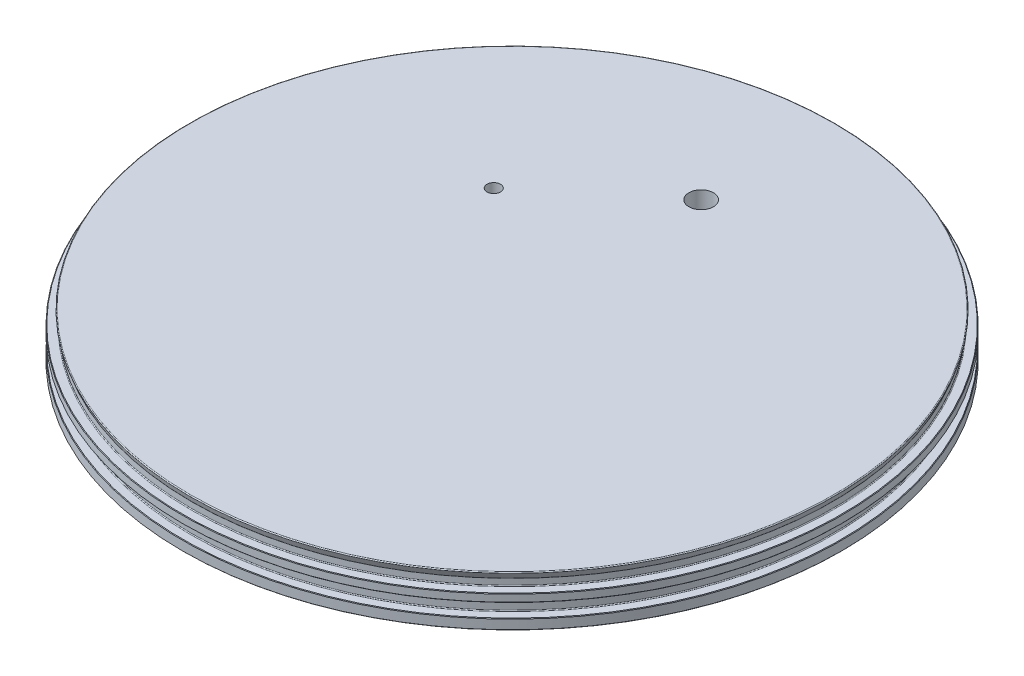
ISO-10303-21;
HEADER;
FILE_DESCRIPTION(('STEP AP214'),'2;1');
FILE_NAME('part.step','',(''),(''),'','','');
FILE_SCHEMA(('AUTOMOTIVE_DESIGN { 1 0 10303 214 1 1 1 1 }'));
ENDSEC;
DATA;
#1=APPLICATION_CONTEXT('core data for automotive mechanical design processes');
#2=APPLICATION_PROTOCOL_DEFINITION('international standard','automotive_design',2000,#1);
#3=PRODUCT_CONTEXT('',#1,'mechanical');
#4=PRODUCT('Part','Part','',(#3));
#5=PRODUCT_RELATED_PRODUCT_CATEGORY('part','',(#4));
#6=PRODUCT_DEFINITION_FORMATION('','',#4);
#7=PRODUCT_DEFINITION_CONTEXT('part definition',#1,'design');
#8=PRODUCT_DEFINITION('design','',#6,#7);
#9=PRODUCT_DEFINITION_SHAPE('','',#8);
#10=(LENGTH_UNIT() NAMED_UNIT(*) SI_UNIT(.MILLI.,.METRE.));
#11=(NAMED_UNIT(*) PLANE_ANGLE_UNIT() SI_UNIT($,.RADIAN.));
#12=(NAMED_UNIT(*) SI_UNIT($,.STERADIAN.) SOLID_ANGLE_UNIT());
#13=UNCERTAINTY_MEASURE_WITH_UNIT(LENGTH_MEASURE(1.E-05),#10,'distance_accuracy_value','');
#14=(GEOMETRIC_REPRESENTATION_CONTEXT(3) GLOBAL_UNCERTAINTY_ASSIGNED_CONTEXT((#13)) GLOBAL_UNIT_ASSIGNED_CONTEXT((#10,
#11,#12)) REPRESENTATION_CONTEXT('',''));
#15=CARTESIAN_POINT('',(0.,0.,0.));
#16=DIRECTION('',(0.,0.,1.));
#17=DIRECTION('',(1.,0.,0.));
#18=AXIS2_PLACEMENT_3D('',#15,#16,#17);
#19=CARTESIAN_POINT('',(0.,0.,0.));
#20=DIRECTION('',(0.,1.,0.));
#21=DIRECTION('',(0.,0.,1.));
#22=AXIS2_PLACEMENT_3D('',#19,#20,#21);
#23=PLANE('',#22);
#24=CARTESIAN_POINT('',(-53.5082043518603,0.,-44.8987145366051));
#25=DIRECTION('',(0.,-1.,0.));
#26=DIRECTION('',(0.,0.,-1.));
#27=AXIS2_PLACEMENT_3D('',#24,#25,#26);
#28=CIRCLE('',#27,6.1849);
#29=CARTESIAN_POINT('',(-53.5082043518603,0.,-51.0836145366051));
#30=VERTEX_POINT('',#29);
#31=EDGE_CURVE('E591',#30,#30,#28,.T.);
#32=ORIENTED_EDGE('',*,*,#31,.F.);
#33=EDGE_LOOP('',(#32));
#34=FACE_BOUND('',#33,.T.);
#35=CARTESIAN_POINT('',(0.,0.,-88.9));
#36=DIRECTION('',(0.,1.,0.));
#37=DIRECTION('',(0.,0.,1.));
#38=AXIS2_PLACEMENT_3D('',#35,#36,#37);
#39=CIRCLE('',#38,5.75436999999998);
#40=CARTESIAN_POINT('',(0.,0.,-83.14563));
#41=VERTEX_POINT('',#40);
#42=EDGE_CURVE('E79',#41,#41,#39,.T.);
#43=ORIENTED_EDGE('',*,*,#42,.T.);
#44=EDGE_LOOP('',(#43));
#45=FACE_BOUND('',#44,.T.);
#46=CARTESIAN_POINT('',(0.,0.,0.));
#47=DIRECTION('',(0.,-1.,0.));
#48=DIRECTION('',(0.,0.,-1.));
#49=AXIS2_PLACEMENT_3D('',#46,#47,#48);
#50=CIRCLE('',#49,124.46);
#51=CARTESIAN_POINT('',(0.,0.,-124.46));
#52=VERTEX_POINT('',#51);
#53=EDGE_CURVE('E109',#52,#52,#50,.T.);
#54=ORIENTED_EDGE('',*,*,#53,.T.);
#55=EDGE_LOOP('',(#54));
#56=FACE_BOUND('',#55,.T.);
#57=ADVANCED_FACE('F34',(#34,#45,#56),#23,.F.);
#58=CARTESIAN_POINT('',(0.,0.,0.));
#59=DIRECTION('',(0.,-1.,0.));
#60=DIRECTION('',(0.,0.,-1.));
#61=AXIS2_PLACEMENT_3D('',#58,#59,#60);
#62=CYLINDRICAL_SURFACE('',#61,124.46);
#63=CARTESIAN_POINT('',(0.,10.033,0.));
#64=DIRECTION('',(0.,1.,0.));
#65=DIRECTION('',(0.,0.,1.));
#66=AXIS2_PLACEMENT_3D('',#63,#64,#65);
#67=CIRCLE('',#66,124.46);
#68=CARTESIAN_POINT('',(0.,10.033,124.46));
#69=VERTEX_POINT('',#68);
#70=EDGE_CURVE('E112',#69,#69,#67,.F.);
#71=ORIENTED_EDGE('',*,*,#70,.T.);
#72=EDGE_LOOP('',(#71));
#73=FACE_BOUND('',#72,.T.);
#74=ORIENTED_EDGE('',*,*,#53,.F.);
#75=EDGE_LOOP('',(#74));
#76=FACE_BOUND('',#75,.T.);
#77=ADVANCED_FACE('F215',(#73,#76),#62,.T.);
#78=CARTESIAN_POINT('',(-124.46,10.414,0.));
#79=DIRECTION('',(0.,1.,0.));
#80=DIRECTION('',(0.,0.,1.));
#81=AXIS2_PLACEMENT_3D('',#78,#79,#80);
#82=PLANE('',#81);
#83=CARTESIAN_POINT('',(68.2625000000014,10.414,-118.23411825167));
#84=DIRECTION('',(0.,-1.,0.));
#85=DIRECTION('',(0.,0.,-1.));
#86=AXIS2_PLACEMENT_3D('',#83,#84,#85);
#87=CIRCLE('',#86,2.55269999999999);
#88=CARTESIAN_POINT('',(68.2625000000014,10.414,-120.78681825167));
#89=VERTEX_POINT('',#88);
#90=EDGE_CURVE('E73',#89,#89,#87,.T.);
#91=ORIENTED_EDGE('',*,*,#90,.F.);
#92=EDGE_LOOP('',(#91));
#93=FACE_BOUND('',#92,.T.);
#94=CARTESIAN_POINT('',(-68.2624999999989,10.414,-118.234118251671));
#95=DIRECTION('',(0.,-1.,0.));
#96=DIRECTION('',(0.,0.,-1.));
#97=AXIS2_PLACEMENT_3D('',#94,#95,#96);
#98=CIRCLE('',#97,2.55269999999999);
#99=CARTESIAN_POINT('',(-68.2624999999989,10.414,-120.786818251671));
#100=VERTEX_POINT('',#99);
#101=EDGE_CURVE('E72',#100,#100,#98,.T.);
#102=ORIENTED_EDGE('',*,*,#101,.F.);
#103=EDGE_LOOP('',(#102));
#104=FACE_BOUND('',#103,.T.);
#105=CARTESIAN_POINT('',(-136.525,10.414,0.));
#106=DIRECTION('',(0.,-1.,0.));
#107=DIRECTION('',(0.,0.,-1.));
#108=AXIS2_PLACEMENT_3D('',#105,#106,#107);
#109=CIRCLE('',#108,2.55269999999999);
#110=CARTESIAN_POINT('',(-136.525,10.414,-2.55269999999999));
#111=VERTEX_POINT('',#110);
#112=EDGE_CURVE('E85',#111,#111,#109,.T.);
#113=ORIENTED_EDGE('',*,*,#112,.F.);
#114=EDGE_LOOP('',(#113));
#115=FACE_BOUND('',#114,.T.);
#116=CARTESIAN_POINT('',(-68.2625000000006,10.414,118.23411825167));
#117=DIRECTION('',(0.,-1.,0.));
#118=DIRECTION('',(0.,0.,-1.));
#119=AXIS2_PLACEMENT_3D('',#116,#117,#118);
#120=CIRCLE('',#119,2.55269999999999);
#121=CARTESIAN_POINT('',(-68.2625000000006,10.414,115.68141825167));
#122=VERTEX_POINT('',#121);
#123=EDGE_CURVE('E91',#122,#122,#120,.T.);
#124=ORIENTED_EDGE('',*,*,#123,.F.);
#125=EDGE_LOOP('',(#124));
#126=FACE_BOUND('',#125,.T.);
#127=CARTESIAN_POINT('',(68.2624999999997,10.414,118.234118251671));
#128=DIRECTION('',(0.,-1.,0.));
#129=DIRECTION('',(0.,0.,-1.));
#130=AXIS2_PLACEMENT_3D('',#127,#128,#129);
#131=CIRCLE('',#130,2.55269999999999);
#132=CARTESIAN_POINT('',(68.2624999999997,10.414,115.681418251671));
#133=VERTEX_POINT('',#132);
#134=EDGE_CURVE('E97',#133,#133,#131,.T.);
#135=ORIENTED_EDGE('',*,*,#134,.F.);
#136=EDGE_LOOP('',(#135));
#137=FACE_BOUND('',#136,.T.);
#138=CARTESIAN_POINT('',(136.525,10.414,0.));
#139=DIRECTION('',(0.,-1.,0.));
#140=DIRECTION('',(0.,0.,-1.));
#141=AXIS2_PLACEMENT_3D('',#138,#139,#140);
#142=CIRCLE('',#141,2.55269999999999);
#143=CARTESIAN_POINT('',(136.525,10.414,-2.55269999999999));
#144=VERTEX_POINT('',#143);
#145=EDGE_CURVE('E103',#144,#144,#142,.T.);
#146=ORIENTED_EDGE('',*,*,#145,.F.);
#147=EDGE_LOOP('',(#146));
#148=FACE_BOUND('',#147,.T.);
#149=CARTESIAN_POINT('',(0.,10.414,0.));
#150=DIRECTION('',(0.,1.,0.));
#151=DIRECTION('',(0.,0.,1.));
#152=AXIS2_PLACEMENT_3D('',#149,#150,#151);
#153=CIRCLE('',#152,154.686);
#154=CARTESIAN_POINT('',(0.,10.414,154.686));
#155=VERTEX_POINT('',#154);
#156=EDGE_CURVE('E157',#155,#155,#153,.F.);
#157=ORIENTED_EDGE('',*,*,#156,.T.);
#158=EDGE_LOOP('',(#157));
#159=FACE_BOUND('',#158,.T.);
#160=CARTESIAN_POINT('',(0.,10.414,0.));
#161=DIRECTION('',(0.,1.,0.));
#162=DIRECTION('',(0.,0.,1.));
#163=AXIS2_PLACEMENT_3D('',#160,#161,#162);
#164=CIRCLE('',#163,124.841);
#165=CARTESIAN_POINT('',(0.,10.414,124.841));
#166=VERTEX_POINT('',#165);
#167=EDGE_CURVE('E115',#166,#166,#164,.T.);
#168=ORIENTED_EDGE('',*,*,#167,.T.);
#169=EDGE_LOOP('',(#168));
#170=FACE_BOUND('',#169,.T.);
#171=ADVANCED_FACE('F221',(#93,#104,#115,#126,#137,#148,#159,#170),#82,.F.);
#172=CARTESIAN_POINT('',(0.,0.,0.));
#173=DIRECTION('',(0.,-1.,0.));
#174=DIRECTION('',(0.,0.,-1.));
#175=AXIS2_PLACEMENT_3D('',#172,#173,#174);
#176=CYLINDRICAL_SURFACE('',#175,154.94);
#177=CARTESIAN_POINT('',(0.,14.986,0.));
#178=DIRECTION('',(0.,-1.,0.));
#179=DIRECTION('',(0.,0.,-1.));
#180=AXIS2_PLACEMENT_3D('',#177,#178,#179);
#181=CIRCLE('',#180,154.94);
#182=CARTESIAN_POINT('',(0.,14.986,-154.94));
#183=VERTEX_POINT('',#182);
#184=EDGE_CURVE('E151',#183,#183,#181,.T.);
#185=ORIENTED_EDGE('',*,*,#184,.T.);
#186=EDGE_LOOP('',(#185));
#187=FACE_BOUND('',#186,.T.);
#188=CARTESIAN_POINT('',(0.,10.668,0.));
#189=DIRECTION('',(0.,1.,0.));
#190=DIRECTION('',(0.,0.,1.));
#191=AXIS2_PLACEMENT_3D('',#188,#189,#190);
#192=CIRCLE('',#191,154.94);
#193=CARTESIAN_POINT('',(0.,10.668,154.94));
#194=VERTEX_POINT('',#193);
#195=EDGE_CURVE('E148',#194,#194,#192,.T.);
#196=ORIENTED_EDGE('',*,*,#195,.T.);
#197=EDGE_LOOP('',(#196));
#198=FACE_BOUND('',#197,.T.);
#199=ADVANCED_FACE('F211',(#187,#198),#176,.T.);
#200=CARTESIAN_POINT('',(-154.94,15.2400000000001,0.));
#201=DIRECTION('',(0.,-1.,0.));
#202=DIRECTION('',(0.,0.,-1.));
#203=AXIS2_PLACEMENT_3D('',#200,#201,#202);
#204=PLANE('',#203);
#205=CARTESIAN_POINT('',(0.,15.2400000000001,0.));
#206=DIRECTION('',(0.,-1.,0.));
#207=DIRECTION('',(0.,0.,-1.));
#208=AXIS2_PLACEMENT_3D('',#205,#206,#207);
#209=CIRCLE('',#208,154.686);
#210=CARTESIAN_POINT('',(0.,15.2400000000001,-154.686));
#211=VERTEX_POINT('',#210);
#212=EDGE_CURVE('E154',#211,#211,#209,.F.);
#213=ORIENTED_EDGE('',*,*,#212,.T.);
#214=EDGE_LOOP('',(#213));
#215=FACE_BOUND('',#214,.T.);
#216=CARTESIAN_POINT('',(0.,15.2400000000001,0.));
#217=DIRECTION('',(0.,-1.,0.));
#218=DIRECTION('',(0.,0.,-1.));
#219=AXIS2_PLACEMENT_3D('',#216,#217,#218);
#220=CIRCLE('',#219,151.003);
#221=CARTESIAN_POINT('',(0.,15.2400000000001,-151.003));
#222=VERTEX_POINT('',#221);
#223=EDGE_CURVE('E136',#222,#222,#220,.T.);
#224=ORIENTED_EDGE('',*,*,#223,.T.);
#225=EDGE_LOOP('',(#224));
#226=FACE_BOUND('',#225,.T.);
#227=ADVANCED_FACE('F205',(#215,#226),#204,.F.);
#228=CARTESIAN_POINT('',(0.,0.,0.));
#229=DIRECTION('',(0.,-1.,0.));
#230=DIRECTION('',(0.,0.,-1.));
#231=AXIS2_PLACEMENT_3D('',#228,#229,#230);
#232=CYLINDRICAL_SURFACE('',#231,150.622);
#233=CARTESIAN_POINT('',(0.,15.6210000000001,0.));
#234=DIRECTION('',(0.,-1.,0.));
#235=DIRECTION('',(0.,0.,-1.));
#236=AXIS2_PLACEMENT_3D('',#233,#234,#235);
#237=CIRCLE('',#236,150.622);
#238=CARTESIAN_POINT('',(0.,15.6210000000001,-150.622));
#239=VERTEX_POINT('',#238);
#240=EDGE_CURVE('E142',#239,#239,#237,.F.);
#241=ORIENTED_EDGE('',*,*,#240,.T.);
#242=EDGE_LOOP('',(#241));
#243=FACE_BOUND('',#242,.T.);
#244=CARTESIAN_POINT('',(0.,21.2090000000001,0.));
#245=DIRECTION('',(0.,1.,0.));
#246=DIRECTION('',(0.,0.,1.));
#247=AXIS2_PLACEMENT_3D('',#244,#245,#246);
#248=CIRCLE('',#247,150.622);
#249=CARTESIAN_POINT('',(0.,21.2090000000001,150.622));
#250=VERTEX_POINT('',#249);
#251=EDGE_CURVE('E139',#250,#250,#248,.F.);
#252=ORIENTED_EDGE('',*,*,#251,.T.);
#253=EDGE_LOOP('',(#252));
#254=FACE_BOUND('',#253,.T.);
#255=ADVANCED_FACE('F192',(#243,#254),#232,.T.);
#256=CARTESIAN_POINT('',(-150.622,21.5900000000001,0.));
#257=DIRECTION('',(0.,1.,0.));
#258=DIRECTION('',(0.,0.,1.));
#259=AXIS2_PLACEMENT_3D('',#256,#257,#258);
#260=PLANE('',#259);
#261=CARTESIAN_POINT('',(0.,21.5900000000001,0.));
#262=DIRECTION('',(0.,1.,0.));
#263=DIRECTION('',(0.,0.,1.));
#264=AXIS2_PLACEMENT_3D('',#261,#262,#263);
#265=CIRCLE('',#264,154.686);
#266=CARTESIAN_POINT('',(0.,21.5900000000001,154.686));
#267=VERTEX_POINT('',#266);
#268=EDGE_CURVE('E11',#267,#267,#265,.F.);
#269=ORIENTED_EDGE('',*,*,#268,.T.);
#270=EDGE_LOOP('',(#269));
#271=FACE_BOUND('',#270,.T.);
#272=CARTESIAN_POINT('',(0.,21.5900000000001,0.));
#273=DIRECTION('',(0.,1.,0.));
#274=DIRECTION('',(0.,0.,1.));
#275=AXIS2_PLACEMENT_3D('',#272,#273,#274);
#276=CIRCLE('',#275,151.003);
#277=CARTESIAN_POINT('',(0.,21.5900000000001,151.003));
#278=VERTEX_POINT('',#277);
#279=EDGE_CURVE('E145',#278,#278,#276,.T.);
#280=ORIENTED_EDGE('',*,*,#279,.T.);
#281=EDGE_LOOP('',(#280));
#282=FACE_BOUND('',#281,.T.);
#283=ADVANCED_FACE('F181',(#271,#282),#260,.F.);
#284=CARTESIAN_POINT('',(0.,0.,0.));
#285=DIRECTION('',(0.,-1.,0.));
#286=DIRECTION('',(0.,0.,-1.));
#287=AXIS2_PLACEMENT_3D('',#284,#285,#286);
#288=CYLINDRICAL_SURFACE('',#287,154.94);
#289=CARTESIAN_POINT('',(0.,25.1460000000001,0.));
#290=DIRECTION('',(0.,-1.,0.));
#291=DIRECTION('',(0.,0.,-1.));
#292=AXIS2_PLACEMENT_3D('',#289,#290,#291);
#293=CIRCLE('',#292,154.94);
#294=CARTESIAN_POINT('',(0.,25.1460000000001,-154.94));
#295=VERTEX_POINT('',#294);
#296=EDGE_CURVE('E163',#295,#295,#293,.T.);
#297=ORIENTED_EDGE('',*,*,#296,.T.);
#298=EDGE_LOOP('',(#297));
#299=FACE_BOUND('',#298,.T.);
#300=CARTESIAN_POINT('',(0.,21.8440000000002,0.));
#301=DIRECTION('',(0.,1.,0.));
#302=DIRECTION('',(0.,0.,1.));
#303=AXIS2_PLACEMENT_3D('',#300,#301,#302);
#304=CIRCLE('',#303,154.94);
#305=CARTESIAN_POINT('',(0.,21.8440000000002,154.94));
#306=VERTEX_POINT('',#305);
#307=EDGE_CURVE('E160',#306,#306,#304,.T.);
#308=ORIENTED_EDGE('',*,*,#307,.T.);
#309=EDGE_LOOP('',(#308));
#310=FACE_BOUND('',#309,.T.);
#311=ADVANCED_FACE('F178',(#299,#310),#288,.T.);
#312=CARTESIAN_POINT('',(-154.94,25.4000000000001,0.));
#313=DIRECTION('',(0.,-1.,0.));
#314=DIRECTION('',(0.,0.,-1.));
#315=AXIS2_PLACEMENT_3D('',#312,#313,#314);
#316=PLANE('',#315);
#317=CARTESIAN_POINT('',(0.,25.4000000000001,0.));
#318=DIRECTION('',(0.,-1.,0.));
#319=DIRECTION('',(0.,0.,-1.));
#320=AXIS2_PLACEMENT_3D('',#317,#318,#319);
#321=CIRCLE('',#320,154.686);
#322=CARTESIAN_POINT('',(0.,25.4000000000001,-154.686));
#323=VERTEX_POINT('',#322);
#324=EDGE_CURVE('E43',#323,#323,#321,.F.);
#325=ORIENTED_EDGE('',*,*,#324,.T.);
#326=EDGE_LOOP('',(#325));
#327=FACE_BOUND('',#326,.T.);
#328=CARTESIAN_POINT('',(0.,25.4000000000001,0.));
#329=DIRECTION('',(0.,-1.,0.));
#330=DIRECTION('',(0.,0.,-1.));
#331=AXIS2_PLACEMENT_3D('',#328,#329,#330);
#332=CIRCLE('',#331,151.003);
#333=CARTESIAN_POINT('',(0.,25.4000000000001,-151.003));
#334=VERTEX_POINT('',#333);
#335=EDGE_CURVE('E133',#334,#334,#332,.T.);
#336=ORIENTED_EDGE('',*,*,#335,.T.);
#337=EDGE_LOOP('',(#336));
#338=FACE_BOUND('',#337,.T.);
#339=ADVANCED_FACE('F169',(#327,#338),#316,.F.);
#340=CARTESIAN_POINT('',(0.,0.,0.));
#341=DIRECTION('',(0.,-1.,0.));
#342=DIRECTION('',(0.,0.,-1.));
#343=AXIS2_PLACEMENT_3D('',#340,#341,#342);
#344=CYLINDRICAL_SURFACE('',#343,150.622);
#345=CARTESIAN_POINT('',(0.,28.5078194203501,0.));
#346=DIRECTION('',(0.,-1.,0.));
#347=DIRECTION('',(0.,0.,-1.));
#348=AXIS2_PLACEMENT_3D('',#345,#346,#347);
#349=CIRCLE('',#348,150.622);
#350=CARTESIAN_POINT('',(0.,28.5078194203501,-150.622));
#351=VERTEX_POINT('',#350);
#352=EDGE_CURVE('E121',#351,#351,#349,.T.);
#353=ORIENTED_EDGE('',*,*,#352,.T.);
#354=EDGE_LOOP('',(#353));
#355=FACE_BOUND('',#354,.T.);
#356=CARTESIAN_POINT('',(0.,25.7810000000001,0.));
#357=DIRECTION('',(0.,-1.,0.));
#358=DIRECTION('',(0.,0.,-1.));
#359=AXIS2_PLACEMENT_3D('',#356,#357,#358);
#360=CIRCLE('',#359,150.622);
#361=CARTESIAN_POINT('',(0.,25.7810000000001,-150.622));
#362=VERTEX_POINT('',#361);
#363=EDGE_CURVE('E118',#362,#362,#360,.F.);
#364=ORIENTED_EDGE('',*,*,#363,.T.);
#365=EDGE_LOOP('',(#364));
#366=FACE_BOUND('',#365,.T.);
#367=ADVANCED_FACE('F306',(#355,#366),#344,.T.);
#368=CARTESIAN_POINT('',(0.,31.75,0.));
#369=DIRECTION('',(0.,1.,0.));
#370=DIRECTION('',(0.,0.,1.));
#371=AXIS2_PLACEMENT_3D('',#368,#369,#370);
#372=CONICAL_SURFACE('',#371,151.777605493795,0.349065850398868);
#373=CARTESIAN_POINT('',(0.,28.6381290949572,0.));
#374=DIRECTION('',(0.,1.,0.));
#375=DIRECTION('',(0.,0.,1.));
#376=AXIS2_PLACEMENT_3D('',#373,#374,#375);
#377=CIRCLE('',#376,150.644977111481);
#378=CARTESIAN_POINT('',(0.,28.6381290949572,150.644977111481));
#379=VERTEX_POINT('',#378);
#380=EDGE_CURVE('E127',#379,#379,#377,.T.);
#381=ORIENTED_EDGE('',*,*,#380,.T.);
#382=EDGE_LOOP('',(#381));
#383=FACE_BOUND('',#382,.T.);
#384=CARTESIAN_POINT('',(0.,31.2386903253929,0.));
#385=DIRECTION('',(0.,-1.,0.));
#386=DIRECTION('',(0.,0.,-1.));
#387=AXIS2_PLACEMENT_3D('',#384,#385,#386);
#388=CIRCLE('',#387,151.591503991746);
#389=CARTESIAN_POINT('',(0.,31.2386903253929,-151.591503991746));
#390=VERTEX_POINT('',#389);
#391=EDGE_CURVE('E124',#390,#390,#388,.T.);
#392=ORIENTED_EDGE('',*,*,#391,.T.);
#393=EDGE_LOOP('',(#392));
#394=FACE_BOUND('',#393,.T.);
#395=ADVANCED_FACE('F302',(#383,#394),#372,.T.);
#396=CARTESIAN_POINT('',(-151.777605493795,31.75,0.));
#397=DIRECTION('',(0.,-1.,0.));
#398=DIRECTION('',(0.,0.,-1.));
#399=AXIS2_PLACEMENT_3D('',#396,#397,#398);
#400=PLANE('',#399);
#401=CARTESIAN_POINT('',(-53.5082043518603,31.75,-44.8987145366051));
#402=DIRECTION('',(0.,-1.,0.));
#403=DIRECTION('',(0.,0.,-1.));
#404=AXIS2_PLACEMENT_3D('',#401,#402,#403);
#405=CIRCLE('',#404,3.17499999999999);
#406=CARTESIAN_POINT('',(-53.5082043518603,31.75,-48.0737145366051));
#407=VERTEX_POINT('',#406);
#408=EDGE_CURVE('E594',#407,#407,#405,.T.);
#409=ORIENTED_EDGE('',*,*,#408,.T.);
#410=EDGE_LOOP('',(#409));
#411=FACE_BOUND('',#410,.T.);
#412=CARTESIAN_POINT('',(0.,31.75,-88.9));
#413=DIRECTION('',(0.,1.,0.));
#414=DIRECTION('',(0.,0.,1.));
#415=AXIS2_PLACEMENT_3D('',#412,#413,#414);
#416=CIRCLE('',#415,5.75436999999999);
#417=CARTESIAN_POINT('',(0.,31.75,-83.14563));
#418=VERTEX_POINT('',#417);
#419=EDGE_CURVE('E570',#418,#418,#416,.T.);
#420=ORIENTED_EDGE('',*,*,#419,.F.);
#421=EDGE_LOOP('',(#420));
#422=FACE_BOUND('',#421,.T.);
#423=CARTESIAN_POINT('',(0.,31.75,0.));
#424=DIRECTION('',(0.,-1.,0.));
#425=DIRECTION('',(0.,0.,-1.));
#426=AXIS2_PLACEMENT_3D('',#423,#424,#425);
#427=CIRCLE('',#426,151.233481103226);
#428=CARTESIAN_POINT('',(0.,31.75,-151.233481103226));
#429=VERTEX_POINT('',#428);
#430=EDGE_CURVE('E130',#429,#429,#427,.F.);
#431=ORIENTED_EDGE('',*,*,#430,.T.);
#432=EDGE_LOOP('',(#431));
#433=FACE_BOUND('',#432,.T.);
#434=ADVANCED_FACE('F232',(#411,#422,#433),#400,.F.);
#435=CARTESIAN_POINT('',(0.,10.033,0.));
#436=DIRECTION('',(0.,1.,0.));
#437=DIRECTION('',(0.,0.,1.));
#438=AXIS2_PLACEMENT_3D('',#435,#436,#437);
#439=TOROIDAL_SURFACE('',#438,124.841,0.381);
#440=ORIENTED_EDGE('',*,*,#167,.F.);
#441=EDGE_LOOP('',(#440));
#442=FACE_BOUND('',#441,.T.);
#443=ORIENTED_EDGE('',*,*,#70,.F.);
#444=EDGE_LOOP('',(#443));
#445=FACE_BOUND('',#444,.T.);
#446=ADVANCED_FACE('F228',(#442,#445),#439,.F.);
#447=CARTESIAN_POINT('',(0.,28.5078194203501,0.));
#448=DIRECTION('',(0.,-1.,0.));
#449=DIRECTION('',(0.,0.,-1.));
#450=AXIS2_PLACEMENT_3D('',#447,#448,#449);
#451=TOROIDAL_SURFACE('',#450,151.003,0.381);
#452=ORIENTED_EDGE('',*,*,#380,.F.);
#453=EDGE_LOOP('',(#452));
#454=FACE_BOUND('',#453,.T.);
#455=ORIENTED_EDGE('',*,*,#352,.F.);
#456=EDGE_LOOP('',(#455));
#457=FACE_BOUND('',#456,.T.);
#458=ADVANCED_FACE('F231',(#454,#457),#451,.F.);
#459=CARTESIAN_POINT('',(0.,31.369,0.));
#460=DIRECTION('',(0.,-1.,0.));
#461=DIRECTION('',(0.,0.,-1.));
#462=AXIS2_PLACEMENT_3D('',#459,#460,#461);
#463=TOROIDAL_SURFACE('',#462,151.233481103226,0.381);
#464=ORIENTED_EDGE('',*,*,#430,.F.);
#465=EDGE_LOOP('',(#464));
#466=FACE_BOUND('',#465,.T.);
#467=ORIENTED_EDGE('',*,*,#391,.F.);
#468=EDGE_LOOP('',(#467));
#469=FACE_BOUND('',#468,.T.);
#470=ADVANCED_FACE('F236',(#466,#469),#463,.T.);
#471=CARTESIAN_POINT('',(0.,25.7810000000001,0.));
#472=DIRECTION('',(0.,-1.,0.));
#473=DIRECTION('',(0.,0.,-1.));
#474=AXIS2_PLACEMENT_3D('',#471,#472,#473);
#475=TOROIDAL_SURFACE('',#474,151.003,0.381);
#476=ORIENTED_EDGE('',*,*,#363,.F.);
#477=EDGE_LOOP('',(#476));
#478=FACE_BOUND('',#477,.T.);
#479=ORIENTED_EDGE('',*,*,#335,.F.);
#480=EDGE_LOOP('',(#479));
#481=FACE_BOUND('',#480,.T.);
#482=ADVANCED_FACE('F240',(#478,#481),#475,.F.);
#483=CARTESIAN_POINT('',(0.,15.6210000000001,0.));
#484=DIRECTION('',(0.,-1.,0.));
#485=DIRECTION('',(0.,0.,-1.));
#486=AXIS2_PLACEMENT_3D('',#483,#484,#485);
#487=TOROIDAL_SURFACE('',#486,151.003,0.381);
#488=ORIENTED_EDGE('',*,*,#240,.F.);
#489=EDGE_LOOP('',(#488));
#490=FACE_BOUND('',#489,.T.);
#491=ORIENTED_EDGE('',*,*,#223,.F.);
#492=EDGE_LOOP('',(#491));
#493=FACE_BOUND('',#492,.T.);
#494=ADVANCED_FACE('F200',(#490,#493),#487,.F.);
#495=CARTESIAN_POINT('',(0.,21.2090000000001,0.));
#496=DIRECTION('',(0.,1.,0.));
#497=DIRECTION('',(0.,0.,1.));
#498=AXIS2_PLACEMENT_3D('',#495,#496,#497);
#499=TOROIDAL_SURFACE('',#498,151.003,0.381);
#500=ORIENTED_EDGE('',*,*,#279,.F.);
#501=EDGE_LOOP('',(#500));
#502=FACE_BOUND('',#501,.T.);
#503=ORIENTED_EDGE('',*,*,#251,.F.);
#504=EDGE_LOOP('',(#503));
#505=FACE_BOUND('',#504,.T.);
#506=ADVANCED_FACE('F196',(#502,#505),#499,.F.);
#507=CARTESIAN_POINT('',(0.,14.986,0.));
#508=DIRECTION('',(0.,-1.,0.));
#509=DIRECTION('',(0.,0.,-1.));
#510=AXIS2_PLACEMENT_3D('',#507,#508,#509);
#511=CONICAL_SURFACE('',#510,154.94,0.785398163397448);
#512=ORIENTED_EDGE('',*,*,#212,.F.);
#513=EDGE_LOOP('',(#512));
#514=FACE_BOUND('',#513,.T.);
#515=ORIENTED_EDGE('',*,*,#184,.F.);
#516=EDGE_LOOP('',(#515));
#517=FACE_BOUND('',#516,.T.);
#518=ADVANCED_FACE('F199',(#514,#517),#511,.T.);
#519=CARTESIAN_POINT('',(0.,10.414,0.));
#520=DIRECTION('',(0.,1.,0.));
#521=DIRECTION('',(0.,0.,1.));
#522=AXIS2_PLACEMENT_3D('',#519,#520,#521);
#523=CONICAL_SURFACE('',#522,154.686,0.785398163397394);
#524=ORIENTED_EDGE('',*,*,#195,.F.);
#525=EDGE_LOOP('',(#524));
#526=FACE_BOUND('',#525,.T.);
#527=ORIENTED_EDGE('',*,*,#156,.F.);
#528=EDGE_LOOP('',(#527));
#529=FACE_BOUND('',#528,.T.);
#530=ADVANCED_FACE('F175',(#526,#529),#523,.T.);
#531=CARTESIAN_POINT('',(0.,25.1460000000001,0.));
#532=DIRECTION('',(0.,-1.,0.));
#533=DIRECTION('',(0.,0.,-1.));
#534=AXIS2_PLACEMENT_3D('',#531,#532,#533);
#535=CONICAL_SURFACE('',#534,154.94,0.785398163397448);
#536=ORIENTED_EDGE('',*,*,#324,.F.);
#537=EDGE_LOOP('',(#536));
#538=FACE_BOUND('',#537,.T.);
#539=ORIENTED_EDGE('',*,*,#296,.F.);
#540=EDGE_LOOP('',(#539));
#541=FACE_BOUND('',#540,.T.);
#542=ADVANCED_FACE('F172',(#538,#541),#535,.T.);
#543=CARTESIAN_POINT('',(0.,21.5900000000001,0.));
#544=DIRECTION('',(0.,1.,0.));
#545=DIRECTION('',(0.,0.,1.));
#546=AXIS2_PLACEMENT_3D('',#543,#544,#545);
#547=CONICAL_SURFACE('',#546,154.686,0.785398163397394);
#548=ORIENTED_EDGE('',*,*,#307,.F.);
#549=EDGE_LOOP('',(#548));
#550=FACE_BOUND('',#549,.T.);
#551=ORIENTED_EDGE('',*,*,#268,.F.);
#552=EDGE_LOOP('',(#551));
#553=FACE_BOUND('',#552,.T.);
#554=ADVANCED_FACE('F36',(#550,#553),#547,.T.);
#555=CARTESIAN_POINT('',(136.525,20.574,0.));
#556=DIRECTION('',(0.,-1.,0.));
#557=DIRECTION('',(0.,0.,-1.));
#558=AXIS2_PLACEMENT_3D('',#555,#556,#557);
#559=CONICAL_SURFACE('',#558,2.55269999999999,1.02974425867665);
#560=CARTESIAN_POINT('',(136.525,22.1078169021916,0.));
#561=VERTEX_POINT('',#560);
#562=VERTEX_LOOP('',#561);
#563=FACE_BOUND('',#562,.T.);
#564=CARTESIAN_POINT('',(136.525,20.574,0.));
#565=DIRECTION('',(0.,-1.,0.));
#566=DIRECTION('',(0.,0.,-1.));
#567=AXIS2_PLACEMENT_3D('',#564,#565,#566);
#568=CIRCLE('',#567,2.55269999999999);
#569=CARTESIAN_POINT('',(136.525,20.574,-2.55269999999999));
#570=VERTEX_POINT('',#569);
#571=EDGE_CURVE('E106',#570,#570,#568,.T.);
#572=ORIENTED_EDGE('',*,*,#571,.T.);
#573=EDGE_LOOP('',(#572));
#574=FACE_BOUND('',#573,.T.);
#575=ADVANCED_FACE('F187',(#563,#574),#559,.F.);
#576=CARTESIAN_POINT('',(136.525,10.414,0.));
#577=DIRECTION('',(0.,-1.,0.));
#578=DIRECTION('',(0.,0.,-1.));
#579=AXIS2_PLACEMENT_3D('',#576,#577,#578);
#580=CYLINDRICAL_SURFACE('',#579,2.55269999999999);
#581=ORIENTED_EDGE('',*,*,#571,.F.);
#582=EDGE_LOOP('',(#581));
#583=FACE_BOUND('',#582,.T.);
#584=ORIENTED_EDGE('',*,*,#145,.T.);
#585=EDGE_LOOP('',(#584));
#586=FACE_BOUND('',#585,.T.);
#587=ADVANCED_FACE('F285',(#583,#586),#580,.F.);
#588=CARTESIAN_POINT('',(68.2624999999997,20.574,118.234118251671));
#589=DIRECTION('',(0.,-1.,0.));
#590=DIRECTION('',(0.,0.,-1.));
#591=AXIS2_PLACEMENT_3D('',#588,#589,#590);
#592=CONICAL_SURFACE('',#591,2.55269999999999,1.02974425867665);
#593=CARTESIAN_POINT('',(68.2624999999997,22.1078169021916,118.234118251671));
#594=VERTEX_POINT('',#593);
#595=VERTEX_LOOP('',#594);
#596=FACE_BOUND('',#595,.T.);
#597=CARTESIAN_POINT('',(68.2624999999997,20.574,118.234118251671));
#598=DIRECTION('',(0.,-1.,0.));
#599=DIRECTION('',(0.,0.,-1.));
#600=AXIS2_PLACEMENT_3D('',#597,#598,#599);
#601=CIRCLE('',#600,2.55269999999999);
#602=CARTESIAN_POINT('',(68.2624999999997,20.574,115.681418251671));
#603=VERTEX_POINT('',#602);
#604=EDGE_CURVE('E100',#603,#603,#601,.T.);
#605=ORIENTED_EDGE('',*,*,#604,.T.);
#606=EDGE_LOOP('',(#605));
#607=FACE_BOUND('',#606,.T.);
#608=ADVANCED_FACE('F287',(#596,#607),#592,.F.);
#609=CARTESIAN_POINT('',(68.2624999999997,10.414,118.234118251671));
#610=DIRECTION('',(0.,-1.,0.));
#611=DIRECTION('',(0.,0.,-1.));
#612=AXIS2_PLACEMENT_3D('',#609,#610,#611);
#613=CYLINDRICAL_SURFACE('',#612,2.55269999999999);
#614=ORIENTED_EDGE('',*,*,#604,.F.);
#615=EDGE_LOOP('',(#614));
#616=FACE_BOUND('',#615,.T.);
#617=ORIENTED_EDGE('',*,*,#134,.T.);
#618=EDGE_LOOP('',(#617));
#619=FACE_BOUND('',#618,.T.);
#620=ADVANCED_FACE('F294',(#616,#619),#613,.F.);
#621=CARTESIAN_POINT('',(-68.2625000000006,20.574,118.23411825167));
#622=DIRECTION('',(0.,-1.,0.));
#623=DIRECTION('',(0.,0.,-1.));
#624=AXIS2_PLACEMENT_3D('',#621,#622,#623);
#625=CONICAL_SURFACE('',#624,2.55269999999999,1.02974425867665);
#626=CARTESIAN_POINT('',(-68.2625000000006,22.1078169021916,118.23411825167));
#627=VERTEX_POINT('',#626);
#628=VERTEX_LOOP('',#627);
#629=FACE_BOUND('',#628,.T.);
#630=CARTESIAN_POINT('',(-68.2625000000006,20.574,118.23411825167));
#631=DIRECTION('',(0.,-1.,0.));
#632=DIRECTION('',(0.,0.,-1.));
#633=AXIS2_PLACEMENT_3D('',#630,#631,#632);
#634=CIRCLE('',#633,2.55269999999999);
#635=CARTESIAN_POINT('',(-68.2625000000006,20.574,115.68141825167));
#636=VERTEX_POINT('',#635);
#637=EDGE_CURVE('E94',#636,#636,#634,.T.);
#638=ORIENTED_EDGE('',*,*,#637,.T.);
#639=EDGE_LOOP('',(#638));
#640=FACE_BOUND('',#639,.T.);
#641=ADVANCED_FACE('F411',(#629,#640),#625,.F.);
#642=CARTESIAN_POINT('',(-68.2625000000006,10.414,118.23411825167));
#643=DIRECTION('',(0.,-1.,0.));
#644=DIRECTION('',(0.,0.,-1.));
#645=AXIS2_PLACEMENT_3D('',#642,#643,#644);
#646=CYLINDRICAL_SURFACE('',#645,2.55269999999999);
#647=ORIENTED_EDGE('',*,*,#637,.F.);
#648=EDGE_LOOP('',(#647));
#649=FACE_BOUND('',#648,.T.);
#650=ORIENTED_EDGE('',*,*,#123,.T.);
#651=EDGE_LOOP('',(#650));
#652=FACE_BOUND('',#651,.T.);
#653=ADVANCED_FACE('F422',(#649,#652),#646,.F.);
#654=CARTESIAN_POINT('',(-136.525,20.574,0.));
#655=DIRECTION('',(0.,-1.,0.));
#656=DIRECTION('',(0.,0.,-1.));
#657=AXIS2_PLACEMENT_3D('',#654,#655,#656);
#658=CONICAL_SURFACE('',#657,2.55269999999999,1.02974425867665);
#659=CARTESIAN_POINT('',(-136.525,22.1078169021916,0.));
#660=VERTEX_POINT('',#659);
#661=VERTEX_LOOP('',#660);
#662=FACE_BOUND('',#661,.T.);
#663=CARTESIAN_POINT('',(-136.525,20.574,0.));
#664=DIRECTION('',(0.,-1.,0.));
#665=DIRECTION('',(0.,0.,-1.));
#666=AXIS2_PLACEMENT_3D('',#663,#664,#665);
#667=CIRCLE('',#666,2.55269999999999);
#668=CARTESIAN_POINT('',(-136.525,20.574,-2.55269999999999));
#669=VERTEX_POINT('',#668);
#670=EDGE_CURVE('E88',#669,#669,#667,.T.);
#671=ORIENTED_EDGE('',*,*,#670,.T.);
#672=EDGE_LOOP('',(#671));
#673=FACE_BOUND('',#672,.T.);
#674=ADVANCED_FACE('F434',(#662,#673),#658,.F.);
#675=CARTESIAN_POINT('',(-136.525,10.414,0.));
#676=DIRECTION('',(0.,-1.,0.));
#677=DIRECTION('',(0.,0.,-1.));
#678=AXIS2_PLACEMENT_3D('',#675,#676,#677);
#679=CYLINDRICAL_SURFACE('',#678,2.55269999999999);
#680=ORIENTED_EDGE('',*,*,#670,.F.);
#681=EDGE_LOOP('',(#680));
#682=FACE_BOUND('',#681,.T.);
#683=ORIENTED_EDGE('',*,*,#112,.T.);
#684=EDGE_LOOP('',(#683));
#685=FACE_BOUND('',#684,.T.);
#686=ADVANCED_FACE('F446',(#682,#685),#679,.F.);
#687=CARTESIAN_POINT('',(-68.2624999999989,20.574,-118.234118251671));
#688=DIRECTION('',(0.,-1.,0.));
#689=DIRECTION('',(0.,0.,-1.));
#690=AXIS2_PLACEMENT_3D('',#687,#688,#689);
#691=CONICAL_SURFACE('',#690,2.55269999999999,1.02974425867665);
#692=CARTESIAN_POINT('',(-68.2624999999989,22.1078169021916,-118.234118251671));
#693=VERTEX_POINT('',#692);
#694=VERTEX_LOOP('',#693);
#695=FACE_BOUND('',#694,.T.);
#696=CARTESIAN_POINT('',(-68.2624999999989,20.574,-118.234118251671));
#697=DIRECTION('',(0.,-1.,0.));
#698=DIRECTION('',(0.,0.,-1.));
#699=AXIS2_PLACEMENT_3D('',#696,#697,#698);
#700=CIRCLE('',#699,2.55269999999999);
#701=CARTESIAN_POINT('',(-68.2624999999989,20.574,-120.786818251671));
#702=VERTEX_POINT('',#701);
#703=EDGE_CURVE('E76',#702,#702,#700,.T.);
#704=ORIENTED_EDGE('',*,*,#703,.T.);
#705=EDGE_LOOP('',(#704));
#706=FACE_BOUND('',#705,.T.);
#707=ADVANCED_FACE('F457',(#695,#706),#691,.F.);
#708=CARTESIAN_POINT('',(-68.2624999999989,10.414,-118.234118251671));
#709=DIRECTION('',(0.,-1.,0.));
#710=DIRECTION('',(0.,0.,-1.));
#711=AXIS2_PLACEMENT_3D('',#708,#709,#710);
#712=CYLINDRICAL_SURFACE('',#711,2.55269999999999);
#713=ORIENTED_EDGE('',*,*,#703,.F.);
#714=EDGE_LOOP('',(#713));
#715=FACE_BOUND('',#714,.T.);
#716=ORIENTED_EDGE('',*,*,#101,.T.);
#717=EDGE_LOOP('',(#716));
#718=FACE_BOUND('',#717,.T.);
#719=ADVANCED_FACE('F66',(#715,#718),#712,.F.);
#720=CARTESIAN_POINT('',(68.2625000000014,20.574,-118.23411825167));
#721=DIRECTION('',(0.,-1.,0.));
#722=DIRECTION('',(0.,0.,-1.));
#723=AXIS2_PLACEMENT_3D('',#720,#721,#722);
#724=CONICAL_SURFACE('',#723,2.55269999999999,1.02974425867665);
#725=CARTESIAN_POINT('',(68.2625000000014,22.1078169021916,-118.23411825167));
#726=VERTEX_POINT('',#725);
#727=VERTEX_LOOP('',#726);
#728=FACE_BOUND('',#727,.T.);
#729=CARTESIAN_POINT('',(68.2625000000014,20.574,-118.23411825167));
#730=DIRECTION('',(0.,-1.,0.));
#731=DIRECTION('',(0.,0.,-1.));
#732=AXIS2_PLACEMENT_3D('',#729,#730,#731);
#733=CIRCLE('',#732,2.55269999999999);
#734=CARTESIAN_POINT('',(68.2625000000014,20.574,-120.78681825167));
#735=VERTEX_POINT('',#734);
#736=EDGE_CURVE('E70',#735,#735,#733,.T.);
#737=ORIENTED_EDGE('',*,*,#736,.T.);
#738=EDGE_LOOP('',(#737));
#739=FACE_BOUND('',#738,.T.);
#740=ADVANCED_FACE('F62',(#728,#739),#724,.F.);
#741=CARTESIAN_POINT('',(68.2625000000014,10.414,-118.23411825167));
#742=DIRECTION('',(0.,-1.,0.));
#743=DIRECTION('',(0.,0.,-1.));
#744=AXIS2_PLACEMENT_3D('',#741,#742,#743);
#745=CYLINDRICAL_SURFACE('',#744,2.55269999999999);
#746=ORIENTED_EDGE('',*,*,#736,.F.);
#747=EDGE_LOOP('',(#746));
#748=FACE_BOUND('',#747,.T.);
#749=ORIENTED_EDGE('',*,*,#90,.T.);
#750=EDGE_LOOP('',(#749));
#751=FACE_BOUND('',#750,.T.);
#752=ADVANCED_FACE('F65',(#748,#751),#745,.F.);
#753=CARTESIAN_POINT('',(0.,31.75,-88.9));
#754=DIRECTION('',(0.,1.,0.));
#755=DIRECTION('',(0.,0.,1.));
#756=AXIS2_PLACEMENT_3D('',#753,#754,#755);
#757=CYLINDRICAL_SURFACE('',#756,5.75436999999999);
#758=ORIENTED_EDGE('',*,*,#42,.F.);
#759=EDGE_LOOP('',(#758));
#760=FACE_BOUND('',#759,.T.);
#761=ORIENTED_EDGE('',*,*,#419,.T.);
#762=EDGE_LOOP('',(#761));
#763=FACE_BOUND('',#762,.T.);
#764=ADVANCED_FACE('F494',(#760,#763),#757,.F.);
#765=CARTESIAN_POINT('',(-53.5082043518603,18.034,-44.8987145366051));
#766=DIRECTION('',(0.,1.,0.));
#767=DIRECTION('',(0.,0.,1.));
#768=AXIS2_PLACEMENT_3D('',#765,#766,#767);
#769=PLANE('',#768);
#770=CARTESIAN_POINT('',(-53.5082043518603,18.034,-44.8987145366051));
#771=DIRECTION('',(0.,1.,0.));
#772=DIRECTION('',(0.,0.,1.));
#773=AXIS2_PLACEMENT_3D('',#770,#771,#772);
#774=CIRCLE('',#773,3.17499999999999);
#775=CARTESIAN_POINT('',(-53.5082043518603,18.034,-41.7237145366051));
#776=VERTEX_POINT('',#775);
#777=EDGE_CURVE('E38',#776,#776,#774,.T.);
#778=ORIENTED_EDGE('',*,*,#777,.T.);
#779=EDGE_LOOP('',(#778));
#780=FACE_BOUND('',#779,.T.);
#781=CARTESIAN_POINT('',(-53.5082043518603,18.034,-44.8987145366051));
#782=DIRECTION('',(0.,-1.,0.));
#783=DIRECTION('',(0.,0.,-1.));
#784=AXIS2_PLACEMENT_3D('',#781,#782,#783);
#785=CIRCLE('',#784,4.96062);
#786=CARTESIAN_POINT('',(-53.5082043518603,18.034,-49.8593345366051));
#787=VERTEX_POINT('',#786);
#788=EDGE_CURVE('E569',#787,#787,#785,.T.);
#789=ORIENTED_EDGE('',*,*,#788,.T.);
#790=EDGE_LOOP('',(#789));
#791=FACE_BOUND('',#790,.T.);
#792=ADVANCED_FACE('F502',(#780,#791),#769,.F.);
#793=CARTESIAN_POINT('',(-53.5082043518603,0.,-44.8987145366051));
#794=DIRECTION('',(0.,-1.,0.));
#795=DIRECTION('',(0.,0.,-1.));
#796=AXIS2_PLACEMENT_3D('',#793,#794,#795);
#797=CYLINDRICAL_SURFACE('',#796,4.96062);
#798=ORIENTED_EDGE('',*,*,#788,.F.);
#799=EDGE_LOOP('',(#798));
#800=FACE_BOUND('',#799,.T.);
#801=CARTESIAN_POINT('',(-53.5082043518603,3.08437889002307,-44.8987145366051));
#802=DIRECTION('',(0.,-1.,0.));
#803=DIRECTION('',(0.,0.,-1.));
#804=AXIS2_PLACEMENT_3D('',#801,#802,#803);
#805=CIRCLE('',#804,4.96062);
#806=CARTESIAN_POINT('',(-53.5082043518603,3.08437889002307,-49.8593345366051));
#807=VERTEX_POINT('',#806);
#808=EDGE_CURVE('E571',#807,#807,#805,.T.);
#809=ORIENTED_EDGE('',*,*,#808,.T.);
#810=EDGE_LOOP('',(#809));
#811=FACE_BOUND('',#810,.T.);
#812=ADVANCED_FACE('F515',(#800,#811),#797,.F.);
#813=CARTESIAN_POINT('',(-53.5082043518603,2.3622,-44.8987145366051));
#814=DIRECTION('',(0.,-1.,0.));
#815=DIRECTION('',(0.,0.,-1.));
#816=AXIS2_PLACEMENT_3D('',#813,#814,#815);
#817=CONICAL_SURFACE('',#816,5.68279889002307,0.785398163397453);
#818=ORIENTED_EDGE('',*,*,#808,.F.);
#819=EDGE_LOOP('',(#818));
#820=FACE_BOUND('',#819,.T.);
#821=CARTESIAN_POINT('',(-53.5082043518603,2.3622,-44.8987145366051));
#822=DIRECTION('',(0.,-1.,0.));
#823=DIRECTION('',(0.,0.,-1.));
#824=AXIS2_PLACEMENT_3D('',#821,#822,#823);
#825=CIRCLE('',#824,5.68279889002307);
#826=CARTESIAN_POINT('',(-53.5082043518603,2.3622,-50.5815134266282));
#827=VERTEX_POINT('',#826);
#828=EDGE_CURVE('E576',#827,#827,#825,.T.);
#829=ORIENTED_EDGE('',*,*,#828,.T.);
#830=EDGE_LOOP('',(#829));
#831=FACE_BOUND('',#830,.T.);
#832=ADVANCED_FACE('F520',(#820,#831),#817,.F.);
#833=CARTESIAN_POINT('',(-53.5082043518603,0.,-44.8987145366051));
#834=DIRECTION('',(0.,-1.,0.));
#835=DIRECTION('',(0.,0.,-1.));
#836=AXIS2_PLACEMENT_3D('',#833,#834,#835);
#837=CONICAL_SURFACE('',#836,6.1849,0.20943951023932);
#838=ORIENTED_EDGE('',*,*,#828,.F.);
#839=EDGE_LOOP('',(#838));
#840=FACE_BOUND('',#839,.T.);
#841=ORIENTED_EDGE('',*,*,#31,.T.);
#842=EDGE_LOOP('',(#841));
#843=FACE_BOUND('',#842,.T.);
#844=ADVANCED_FACE('F530',(#840,#843),#837,.F.);
#845=CARTESIAN_POINT('',(-53.5082043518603,0.,-44.8987145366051));
#846=DIRECTION('',(0.,-1.,0.));
#847=DIRECTION('',(0.,0.,-1.));
#848=AXIS2_PLACEMENT_3D('',#845,#846,#847);
#849=CYLINDRICAL_SURFACE('',#848,3.17499999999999);
#850=ORIENTED_EDGE('',*,*,#408,.F.);
#851=EDGE_LOOP('',(#850));
#852=FACE_BOUND('',#851,.T.);
#853=ORIENTED_EDGE('',*,*,#777,.F.);
#854=EDGE_LOOP('',(#853));
#855=FACE_BOUND('',#854,.T.);
#856=ADVANCED_FACE('F539',(#852,#855),#849,.F.);
#857=CLOSED_SHELL('',(#57,#77,#171,#199,#227,#255,#283,#311,#339,#367,#395,#434,#446,#458,#470,
#482,#494,#506,#518,#530,#542,#554,#575,#587,#608,#620,#641,#653,#674,#686,#707,#719,#740,#752,
#764,#792,#812,#832,#844,#856));
#858=MANIFOLD_SOLID_BREP('B2',#857);
#859=ADVANCED_BREP_SHAPE_REPRESENTATION('',(#18,#858),#14);
#860=SHAPE_DEFINITION_REPRESENTATION(#9,#859);
ENDSEC;
END-ISO-10303-21;
